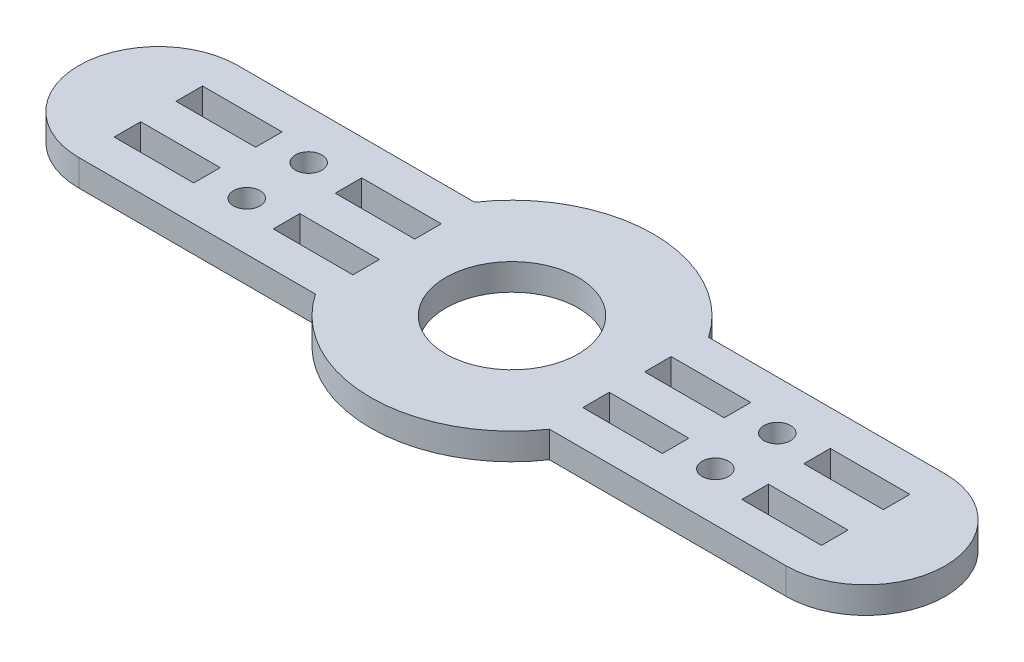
ISO-10303-21;
HEADER;
FILE_DESCRIPTION(('STEP AP214'),'2;1');
FILE_NAME('part.step','',(''),(''),'','','');
FILE_SCHEMA(('AUTOMOTIVE_DESIGN { 1 0 10303 214 1 1 1 1 }'));
ENDSEC;
DATA;
#1=APPLICATION_CONTEXT('core data for automotive mechanical design processes');
#2=APPLICATION_PROTOCOL_DEFINITION('international standard','automotive_design',2000,#1);
#3=PRODUCT_CONTEXT('',#1,'mechanical');
#4=PRODUCT('Part','Part','',(#3));
#5=PRODUCT_RELATED_PRODUCT_CATEGORY('part','',(#4));
#6=PRODUCT_DEFINITION_FORMATION('','',#4);
#7=PRODUCT_DEFINITION_CONTEXT('part definition',#1,'design');
#8=PRODUCT_DEFINITION('design','',#6,#7);
#9=PRODUCT_DEFINITION_SHAPE('','',#8);
#10=(LENGTH_UNIT() NAMED_UNIT(*) SI_UNIT(.MILLI.,.METRE.));
#11=(NAMED_UNIT(*) PLANE_ANGLE_UNIT() SI_UNIT($,.RADIAN.));
#12=(NAMED_UNIT(*) SI_UNIT($,.STERADIAN.) SOLID_ANGLE_UNIT());
#13=UNCERTAINTY_MEASURE_WITH_UNIT(LENGTH_MEASURE(1.E-05),#10,'distance_accuracy_value','');
#14=(GEOMETRIC_REPRESENTATION_CONTEXT(3) GLOBAL_UNCERTAINTY_ASSIGNED_CONTEXT((#13)) GLOBAL_UNIT_ASSIGNED_CONTEXT((#10,
#11,#12)) REPRESENTATION_CONTEXT('',''));
#15=CARTESIAN_POINT('',(0.,0.,0.));
#16=DIRECTION('',(0.,0.,1.));
#17=DIRECTION('',(1.,0.,0.));
#18=AXIS2_PLACEMENT_3D('',#15,#16,#17);
#19=CARTESIAN_POINT('',(0.,3.,8.99999999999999));
#20=DIRECTION('',(0.,0.,-1.));
#21=DIRECTION('',(-1.,0.,0.));
#22=AXIS2_PLACEMENT_3D('',#19,#20,#21);
#23=PLANE('',#22);
#24=DIRECTION('',(1.,0.,0.));
#25=VECTOR('',#24,1.);
#26=CARTESIAN_POINT('',(0.,0.,8.99999999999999));
#27=LINE('',#26,#25);
#28=CARTESIAN_POINT('',(-40.,0.,9.));
#29=VERTEX_POINT('',#28);
#30=CARTESIAN_POINT('',(-13.228756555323,0.,9.));
#31=VERTEX_POINT('',#30);
#32=EDGE_CURVE('E638',#29,#31,#27,.T.);
#33=ORIENTED_EDGE('',*,*,#32,.T.);
#34=DIRECTION('',(0.,-1.,0.));
#35=VECTOR('',#34,1.);
#36=CARTESIAN_POINT('',(-13.228756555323,3.,9.));
#37=LINE('',#36,#35);
#38=CARTESIAN_POINT('',(-13.228756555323,3.,9.));
#39=VERTEX_POINT('',#38);
#40=EDGE_CURVE('E11',#39,#31,#37,.T.);
#41=ORIENTED_EDGE('',*,*,#40,.F.);
#42=DIRECTION('',(1.,0.,0.));
#43=VECTOR('',#42,1.);
#44=CARTESIAN_POINT('',(0.,3.,8.99999999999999));
#45=LINE('',#44,#43);
#46=CARTESIAN_POINT('',(-40.,3.,9.));
#47=VERTEX_POINT('',#46);
#48=EDGE_CURVE('E331',#47,#39,#45,.T.);
#49=ORIENTED_EDGE('',*,*,#48,.F.);
#50=DIRECTION('',(0.,-1.,0.));
#51=VECTOR('',#50,1.);
#52=CARTESIAN_POINT('',(-40.,3.,9.));
#53=LINE('',#52,#51);
#54=EDGE_CURVE('E443',#47,#29,#53,.T.);
#55=ORIENTED_EDGE('',*,*,#54,.T.);
#56=EDGE_LOOP('',(#33,#41,#49,#55));
#57=FACE_BOUND('',#56,.T.);
#58=ADVANCED_FACE('F34',(#57),#23,.F.);
#59=CARTESIAN_POINT('',(0.,3.,0.));
#60=DIRECTION('',(0.,-1.,0.));
#61=DIRECTION('',(0.,0.,-1.));
#62=AXIS2_PLACEMENT_3D('',#59,#60,#61);
#63=CYLINDRICAL_SURFACE('',#62,16.);
#64=CARTESIAN_POINT('',(0.,0.,0.));
#65=DIRECTION('',(0.,1.,0.));
#66=DIRECTION('',(0.,0.,1.));
#67=AXIS2_PLACEMENT_3D('',#64,#65,#66);
#68=CIRCLE('',#67,16.);
#69=CARTESIAN_POINT('',(13.228756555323,0.,8.99999999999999));
#70=VERTEX_POINT('',#69);
#71=EDGE_CURVE('E641',#31,#70,#68,.T.);
#72=ORIENTED_EDGE('',*,*,#71,.T.);
#73=DIRECTION('',(0.,-1.,0.));
#74=VECTOR('',#73,1.);
#75=CARTESIAN_POINT('',(13.228756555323,3.,8.99999999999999));
#76=LINE('',#75,#74);
#77=CARTESIAN_POINT('',(13.228756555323,3.,8.99999999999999));
#78=VERTEX_POINT('',#77);
#79=EDGE_CURVE('E44',#78,#70,#76,.T.);
#80=ORIENTED_EDGE('',*,*,#79,.F.);
#81=CARTESIAN_POINT('',(0.,3.,0.));
#82=DIRECTION('',(0.,1.,0.));
#83=DIRECTION('',(0.,0.,1.));
#84=AXIS2_PLACEMENT_3D('',#81,#82,#83);
#85=CIRCLE('',#84,16.);
#86=EDGE_CURVE('E329',#39,#78,#85,.T.);
#87=ORIENTED_EDGE('',*,*,#86,.F.);
#88=ORIENTED_EDGE('',*,*,#40,.T.);
#89=EDGE_LOOP('',(#72,#80,#87,#88));
#90=FACE_BOUND('',#89,.T.);
#91=ADVANCED_FACE('F673',(#90),#63,.T.);
#92=CARTESIAN_POINT('',(40.,0.,8.99999999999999));
#93=VERTEX_POINT('',#92);
#94=EDGE_CURVE('E642',#70,#93,#27,.T.);
#95=ORIENTED_EDGE('',*,*,#94,.T.);
#96=DIRECTION('',(0.,-1.,0.));
#97=VECTOR('',#96,1.);
#98=CARTESIAN_POINT('',(40.,3.,8.99999999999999));
#99=LINE('',#98,#97);
#100=CARTESIAN_POINT('',(40.,3.,8.99999999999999));
#101=VERTEX_POINT('',#100);
#102=EDGE_CURVE('E450',#101,#93,#99,.T.);
#103=ORIENTED_EDGE('',*,*,#102,.F.);
#104=EDGE_CURVE('E326',#78,#101,#45,.T.);
#105=ORIENTED_EDGE('',*,*,#104,.F.);
#106=ORIENTED_EDGE('',*,*,#79,.T.);
#107=EDGE_LOOP('',(#95,#103,#105,#106));
#108=FACE_BOUND('',#107,.T.);
#109=ADVANCED_FACE('F675',(#108),#23,.F.);
#110=CARTESIAN_POINT('',(40.,3.,0.));
#111=DIRECTION('',(0.,-1.,0.));
#112=DIRECTION('',(0.,0.,-1.));
#113=AXIS2_PLACEMENT_3D('',#110,#111,#112);
#114=CYLINDRICAL_SURFACE('',#113,9.);
#115=CARTESIAN_POINT('',(40.,0.,0.));
#116=DIRECTION('',(0.,1.,0.));
#117=DIRECTION('',(0.,0.,1.));
#118=AXIS2_PLACEMENT_3D('',#115,#116,#117);
#119=CIRCLE('',#118,9.);
#120=CARTESIAN_POINT('',(40.,0.,-9.00000000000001));
#121=VERTEX_POINT('',#120);
#122=EDGE_CURVE('E644',#93,#121,#119,.T.);
#123=ORIENTED_EDGE('',*,*,#122,.T.);
#124=DIRECTION('',(0.,-1.,0.));
#125=VECTOR('',#124,1.);
#126=CARTESIAN_POINT('',(40.,3.,-9.00000000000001));
#127=LINE('',#126,#125);
#128=CARTESIAN_POINT('',(40.,3.,-9.00000000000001));
#129=VERTEX_POINT('',#128);
#130=EDGE_CURVE('E448',#129,#121,#127,.T.);
#131=ORIENTED_EDGE('',*,*,#130,.F.);
#132=CARTESIAN_POINT('',(40.,3.,0.));
#133=DIRECTION('',(0.,1.,0.));
#134=DIRECTION('',(0.,0.,1.));
#135=AXIS2_PLACEMENT_3D('',#132,#133,#134);
#136=CIRCLE('',#135,9.);
#137=EDGE_CURVE('E324',#101,#129,#136,.T.);
#138=ORIENTED_EDGE('',*,*,#137,.F.);
#139=ORIENTED_EDGE('',*,*,#102,.T.);
#140=EDGE_LOOP('',(#123,#131,#138,#139));
#141=FACE_BOUND('',#140,.T.);
#142=ADVANCED_FACE('F683',(#141),#114,.T.);
#143=CARTESIAN_POINT('',(0.,3.,-9.00000000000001));
#144=DIRECTION('',(0.,0.,-1.));
#145=DIRECTION('',(-1.,0.,0.));
#146=AXIS2_PLACEMENT_3D('',#143,#144,#145);
#147=PLANE('',#146);
#148=DIRECTION('',(1.,0.,0.));
#149=VECTOR('',#148,1.);
#150=CARTESIAN_POINT('',(0.,0.,-9.00000000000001));
#151=LINE('',#150,#149);
#152=CARTESIAN_POINT('',(13.2287565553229,0.,-9.00000000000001));
#153=VERTEX_POINT('',#152);
#154=EDGE_CURVE('E647',#153,#121,#151,.T.);
#155=ORIENTED_EDGE('',*,*,#154,.F.);
#156=DIRECTION('',(0.,-1.,0.));
#157=VECTOR('',#156,1.);
#158=CARTESIAN_POINT('',(13.2287565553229,3.,-9.00000000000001));
#159=LINE('',#158,#157);
#160=CARTESIAN_POINT('',(13.2287565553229,3.,-9.00000000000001));
#161=VERTEX_POINT('',#160);
#162=EDGE_CURVE('E317',#161,#153,#159,.T.);
#163=ORIENTED_EDGE('',*,*,#162,.F.);
#164=DIRECTION('',(1.,0.,0.));
#165=VECTOR('',#164,1.);
#166=CARTESIAN_POINT('',(0.,3.,-9.00000000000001));
#167=LINE('',#166,#165);
#168=EDGE_CURVE('E306',#161,#129,#167,.T.);
#169=ORIENTED_EDGE('',*,*,#168,.T.);
#170=ORIENTED_EDGE('',*,*,#130,.T.);
#171=EDGE_LOOP('',(#155,#163,#169,#170));
#172=FACE_BOUND('',#171,.T.);
#173=ADVANCED_FACE('F688',(#172),#147,.T.);
#174=CARTESIAN_POINT('',(0.,3.,0.));
#175=DIRECTION('',(0.,-1.,0.));
#176=DIRECTION('',(0.,0.,-1.));
#177=AXIS2_PLACEMENT_3D('',#174,#175,#176);
#178=CYLINDRICAL_SURFACE('',#177,16.);
#179=CARTESIAN_POINT('',(0.,0.,0.));
#180=DIRECTION('',(0.,1.,0.));
#181=DIRECTION('',(0.,0.,1.));
#182=AXIS2_PLACEMENT_3D('',#179,#180,#181);
#183=CIRCLE('',#182,16.);
#184=CARTESIAN_POINT('',(-13.228756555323,0.,-9.00000000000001));
#185=VERTEX_POINT('',#184);
#186=EDGE_CURVE('E313',#153,#185,#183,.T.);
#187=ORIENTED_EDGE('',*,*,#186,.T.);
#188=DIRECTION('',(0.,-1.,0.));
#189=VECTOR('',#188,1.);
#190=CARTESIAN_POINT('',(-13.228756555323,3.,-9.00000000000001));
#191=LINE('',#190,#189);
#192=CARTESIAN_POINT('',(-13.228756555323,3.,-9.00000000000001));
#193=VERTEX_POINT('',#192);
#194=EDGE_CURVE('E310',#193,#185,#191,.T.);
#195=ORIENTED_EDGE('',*,*,#194,.F.);
#196=CARTESIAN_POINT('',(0.,3.,0.));
#197=DIRECTION('',(0.,1.,0.));
#198=DIRECTION('',(0.,0.,1.));
#199=AXIS2_PLACEMENT_3D('',#196,#197,#198);
#200=CIRCLE('',#199,16.);
#201=EDGE_CURVE('E299',#161,#193,#200,.T.);
#202=ORIENTED_EDGE('',*,*,#201,.F.);
#203=ORIENTED_EDGE('',*,*,#162,.T.);
#204=EDGE_LOOP('',(#187,#195,#202,#203));
#205=FACE_BOUND('',#204,.T.);
#206=ADVANCED_FACE('F311',(#205),#178,.T.);
#207=CARTESIAN_POINT('',(-40.,0.,-9.));
#208=VERTEX_POINT('',#207);
#209=EDGE_CURVE('E439',#208,#185,#151,.T.);
#210=ORIENTED_EDGE('',*,*,#209,.F.);
#211=DIRECTION('',(0.,-1.,0.));
#212=VECTOR('',#211,1.);
#213=CARTESIAN_POINT('',(-40.,3.,-9.));
#214=LINE('',#213,#212);
#215=CARTESIAN_POINT('',(-40.,3.,-9.));
#216=VERTEX_POINT('',#215);
#217=EDGE_CURVE('E177',#216,#208,#214,.T.);
#218=ORIENTED_EDGE('',*,*,#217,.F.);
#219=EDGE_CURVE('E304',#216,#193,#167,.T.);
#220=ORIENTED_EDGE('',*,*,#219,.T.);
#221=ORIENTED_EDGE('',*,*,#194,.T.);
#222=EDGE_LOOP('',(#210,#218,#220,#221));
#223=FACE_BOUND('',#222,.T.);
#224=ADVANCED_FACE('F319',(#223),#147,.T.);
#225=CARTESIAN_POINT('',(31.,3.,0.));
#226=DIRECTION('',(1.,0.,0.));
#227=DIRECTION('',(0.,0.,-1.));
#228=AXIS2_PLACEMENT_3D('',#225,#226,#227);
#229=PLANE('',#228);
#230=DIRECTION('',(0.,0.,1.));
#231=VECTOR('',#230,1.);
#232=CARTESIAN_POINT('',(31.,0.,0.));
#233=LINE('',#232,#231);
#234=CARTESIAN_POINT('',(31.,0.,-5.));
#235=VERTEX_POINT('',#234);
#236=CARTESIAN_POINT('',(31.,0.,-2.));
#237=VERTEX_POINT('',#236);
#238=EDGE_CURVE('E623',#235,#237,#233,.T.);
#239=ORIENTED_EDGE('',*,*,#238,.F.);
#240=DIRECTION('',(0.,-1.,0.));
#241=VECTOR('',#240,1.);
#242=CARTESIAN_POINT('',(31.,3.,-5.));
#243=LINE('',#242,#241);
#244=CARTESIAN_POINT('',(31.,3.,-5.));
#245=VERTEX_POINT('',#244);
#246=EDGE_CURVE('E445',#245,#235,#243,.T.);
#247=ORIENTED_EDGE('',*,*,#246,.F.);
#248=DIRECTION('',(0.,0.,1.));
#249=VECTOR('',#248,1.);
#250=CARTESIAN_POINT('',(31.,3.,0.));
#251=LINE('',#250,#249);
#252=CARTESIAN_POINT('',(31.,3.,-2.));
#253=VERTEX_POINT('',#252);
#254=EDGE_CURVE('E345',#245,#253,#251,.T.);
#255=ORIENTED_EDGE('',*,*,#254,.T.);
#256=DIRECTION('',(0.,-1.,0.));
#257=VECTOR('',#256,1.);
#258=CARTESIAN_POINT('',(31.,3.,-2.));
#259=LINE('',#258,#257);
#260=EDGE_CURVE('E455',#253,#237,#259,.T.);
#261=ORIENTED_EDGE('',*,*,#260,.T.);
#262=EDGE_LOOP('',(#239,#247,#255,#261));
#263=FACE_BOUND('',#262,.T.);
#264=ADVANCED_FACE('F700',(#263),#229,.T.);
#265=CARTESIAN_POINT('',(0.,3.,-5.00000000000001));
#266=DIRECTION('',(0.,0.,1.));
#267=DIRECTION('',(1.,0.,0.));
#268=AXIS2_PLACEMENT_3D('',#265,#266,#267);
#269=PLANE('',#268);
#270=DIRECTION('',(-1.,0.,0.));
#271=VECTOR('',#270,1.);
#272=CARTESIAN_POINT('',(0.,0.,-5.00000000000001));
#273=LINE('',#272,#271);
#274=CARTESIAN_POINT('',(40.,0.,-5.));
#275=VERTEX_POINT('',#274);
#276=EDGE_CURVE('E626',#275,#235,#273,.T.);
#277=ORIENTED_EDGE('',*,*,#276,.F.);
#278=DIRECTION('',(0.,-1.,0.));
#279=VECTOR('',#278,1.);
#280=CARTESIAN_POINT('',(40.,3.,-5.));
#281=LINE('',#280,#279);
#282=CARTESIAN_POINT('',(40.,3.,-5.));
#283=VERTEX_POINT('',#282);
#284=EDGE_CURVE('E461',#283,#275,#281,.T.);
#285=ORIENTED_EDGE('',*,*,#284,.F.);
#286=DIRECTION('',(-1.,0.,0.));
#287=VECTOR('',#286,1.);
#288=CARTESIAN_POINT('',(0.,3.,-5.00000000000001));
#289=LINE('',#288,#287);
#290=EDGE_CURVE('E342',#283,#245,#289,.T.);
#291=ORIENTED_EDGE('',*,*,#290,.T.);
#292=ORIENTED_EDGE('',*,*,#246,.T.);
#293=EDGE_LOOP('',(#277,#285,#291,#292));
#294=FACE_BOUND('',#293,.T.);
#295=ADVANCED_FACE('F704',(#294),#269,.T.);
#296=CARTESIAN_POINT('',(40.,3.,0.));
#297=DIRECTION('',(1.,0.,0.));
#298=DIRECTION('',(0.,0.,-1.));
#299=AXIS2_PLACEMENT_3D('',#296,#297,#298);
#300=PLANE('',#299);
#301=DIRECTION('',(0.,0.,1.));
#302=VECTOR('',#301,1.);
#303=CARTESIAN_POINT('',(40.,0.,0.));
#304=LINE('',#303,#302);
#305=CARTESIAN_POINT('',(40.,0.,-2.));
#306=VERTEX_POINT('',#305);
#307=EDGE_CURVE('E629',#275,#306,#304,.T.);
#308=ORIENTED_EDGE('',*,*,#307,.T.);
#309=DIRECTION('',(0.,-1.,0.));
#310=VECTOR('',#309,1.);
#311=CARTESIAN_POINT('',(40.,3.,-2.));
#312=LINE('',#311,#310);
#313=CARTESIAN_POINT('',(40.,3.,-2.));
#314=VERTEX_POINT('',#313);
#315=EDGE_CURVE('E457',#314,#306,#312,.T.);
#316=ORIENTED_EDGE('',*,*,#315,.F.);
#317=DIRECTION('',(0.,0.,1.));
#318=VECTOR('',#317,1.);
#319=CARTESIAN_POINT('',(40.,3.,0.));
#320=LINE('',#319,#318);
#321=EDGE_CURVE('E339',#283,#314,#320,.T.);
#322=ORIENTED_EDGE('',*,*,#321,.F.);
#323=ORIENTED_EDGE('',*,*,#284,.T.);
#324=EDGE_LOOP('',(#308,#316,#322,#323));
#325=FACE_BOUND('',#324,.T.);
#326=ADVANCED_FACE('F710',(#325),#300,.F.);
#327=CARTESIAN_POINT('',(13.,3.,0.));
#328=DIRECTION('',(1.,0.,0.));
#329=DIRECTION('',(0.,0.,-1.));
#330=AXIS2_PLACEMENT_3D('',#327,#328,#329);
#331=PLANE('',#330);
#332=DIRECTION('',(0.,0.,1.));
#333=VECTOR('',#332,1.);
#334=CARTESIAN_POINT('',(13.,0.,0.));
#335=LINE('',#334,#333);
#336=CARTESIAN_POINT('',(13.,0.,-5.));
#337=VERTEX_POINT('',#336);
#338=CARTESIAN_POINT('',(13.,0.,-1.99999999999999));
#339=VERTEX_POINT('',#338);
#340=EDGE_CURVE('E611',#337,#339,#335,.T.);
#341=ORIENTED_EDGE('',*,*,#340,.F.);
#342=DIRECTION('',(0.,-1.,0.));
#343=VECTOR('',#342,1.);
#344=CARTESIAN_POINT('',(13.,3.,-5.));
#345=LINE('',#344,#343);
#346=CARTESIAN_POINT('',(13.,3.,-5.));
#347=VERTEX_POINT('',#346);
#348=EDGE_CURVE('E458',#347,#337,#345,.T.);
#349=ORIENTED_EDGE('',*,*,#348,.F.);
#350=DIRECTION('',(0.,0.,1.));
#351=VECTOR('',#350,1.);
#352=CARTESIAN_POINT('',(13.,3.,0.));
#353=LINE('',#352,#351);
#354=CARTESIAN_POINT('',(13.,3.,-1.99999999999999));
#355=VERTEX_POINT('',#354);
#356=EDGE_CURVE('E356',#347,#355,#353,.T.);
#357=ORIENTED_EDGE('',*,*,#356,.T.);
#358=DIRECTION('',(0.,-1.,0.));
#359=VECTOR('',#358,1.);
#360=CARTESIAN_POINT('',(13.,3.,-1.99999999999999));
#361=LINE('',#360,#359);
#362=EDGE_CURVE('E464',#355,#339,#361,.T.);
#363=ORIENTED_EDGE('',*,*,#362,.T.);
#364=EDGE_LOOP('',(#341,#349,#357,#363));
#365=FACE_BOUND('',#364,.T.);
#366=ADVANCED_FACE('F729',(#365),#331,.T.);
#367=CARTESIAN_POINT('',(0.,3.,-5.));
#368=DIRECTION('',(0.,0.,1.));
#369=DIRECTION('',(1.,0.,0.));
#370=AXIS2_PLACEMENT_3D('',#367,#368,#369);
#371=PLANE('',#370);
#372=DIRECTION('',(-1.,0.,0.));
#373=VECTOR('',#372,1.);
#374=CARTESIAN_POINT('',(0.,0.,-5.));
#375=LINE('',#374,#373);
#376=CARTESIAN_POINT('',(22.,0.,-5.));
#377=VERTEX_POINT('',#376);
#378=EDGE_CURVE('E614',#377,#337,#375,.T.);
#379=ORIENTED_EDGE('',*,*,#378,.F.);
#380=DIRECTION('',(0.,-1.,0.));
#381=VECTOR('',#380,1.);
#382=CARTESIAN_POINT('',(22.,3.,-5.));
#383=LINE('',#382,#381);
#384=CARTESIAN_POINT('',(22.,3.,-5.));
#385=VERTEX_POINT('',#384);
#386=EDGE_CURVE('E470',#385,#377,#383,.T.);
#387=ORIENTED_EDGE('',*,*,#386,.F.);
#388=DIRECTION('',(-1.,0.,0.));
#389=VECTOR('',#388,1.);
#390=CARTESIAN_POINT('',(0.,3.,-5.));
#391=LINE('',#390,#389);
#392=EDGE_CURVE('E353',#385,#347,#391,.T.);
#393=ORIENTED_EDGE('',*,*,#392,.T.);
#394=ORIENTED_EDGE('',*,*,#348,.T.);
#395=EDGE_LOOP('',(#379,#387,#393,#394));
#396=FACE_BOUND('',#395,.T.);
#397=ADVANCED_FACE('F725',(#396),#371,.T.);
#398=CARTESIAN_POINT('',(22.,3.,0.));
#399=DIRECTION('',(1.,0.,0.));
#400=DIRECTION('',(0.,0.,-1.));
#401=AXIS2_PLACEMENT_3D('',#398,#399,#400);
#402=PLANE('',#401);
#403=DIRECTION('',(0.,0.,1.));
#404=VECTOR('',#403,1.);
#405=CARTESIAN_POINT('',(22.,0.,0.));
#406=LINE('',#405,#404);
#407=CARTESIAN_POINT('',(22.,0.,-2.));
#408=VERTEX_POINT('',#407);
#409=EDGE_CURVE('E617',#377,#408,#406,.T.);
#410=ORIENTED_EDGE('',*,*,#409,.T.);
#411=DIRECTION('',(0.,-1.,0.));
#412=VECTOR('',#411,1.);
#413=CARTESIAN_POINT('',(22.,3.,-2.));
#414=LINE('',#413,#412);
#415=CARTESIAN_POINT('',(22.,3.,-2.));
#416=VERTEX_POINT('',#415);
#417=EDGE_CURVE('E466',#416,#408,#414,.T.);
#418=ORIENTED_EDGE('',*,*,#417,.F.);
#419=DIRECTION('',(0.,0.,1.));
#420=VECTOR('',#419,1.);
#421=CARTESIAN_POINT('',(22.,3.,0.));
#422=LINE('',#421,#420);
#423=EDGE_CURVE('E350',#385,#416,#422,.T.);
#424=ORIENTED_EDGE('',*,*,#423,.F.);
#425=ORIENTED_EDGE('',*,*,#386,.T.);
#426=EDGE_LOOP('',(#410,#418,#424,#425));
#427=FACE_BOUND('',#426,.T.);
#428=ADVANCED_FACE('F721',(#427),#402,.F.);
#429=CARTESIAN_POINT('',(-31.,3.,0.));
#430=DIRECTION('',(-1.,0.,0.));
#431=DIRECTION('',(0.,0.,1.));
#432=AXIS2_PLACEMENT_3D('',#429,#430,#431);
#433=PLANE('',#432);
#434=DIRECTION('',(0.,0.,-1.));
#435=VECTOR('',#434,1.);
#436=CARTESIAN_POINT('',(-31.,0.,0.));
#437=LINE('',#436,#435);
#438=CARTESIAN_POINT('',(-31.,0.,5.));
#439=VERTEX_POINT('',#438);
#440=CARTESIAN_POINT('',(-31.,0.,2.));
#441=VERTEX_POINT('',#440);
#442=EDGE_CURVE('E599',#439,#441,#437,.T.);
#443=ORIENTED_EDGE('',*,*,#442,.F.);
#444=DIRECTION('',(0.,-1.,0.));
#445=VECTOR('',#444,1.);
#446=CARTESIAN_POINT('',(-31.,3.,5.));
#447=LINE('',#446,#445);
#448=CARTESIAN_POINT('',(-31.,3.,5.));
#449=VERTEX_POINT('',#448);
#450=EDGE_CURVE('E467',#449,#439,#447,.T.);
#451=ORIENTED_EDGE('',*,*,#450,.F.);
#452=DIRECTION('',(0.,0.,-1.));
#453=VECTOR('',#452,1.);
#454=CARTESIAN_POINT('',(-31.,3.,0.));
#455=LINE('',#454,#453);
#456=CARTESIAN_POINT('',(-31.,3.,2.));
#457=VERTEX_POINT('',#456);
#458=EDGE_CURVE('E367',#449,#457,#455,.T.);
#459=ORIENTED_EDGE('',*,*,#458,.T.);
#460=DIRECTION('',(0.,-1.,0.));
#461=VECTOR('',#460,1.);
#462=CARTESIAN_POINT('',(-31.,3.,2.));
#463=LINE('',#462,#461);
#464=EDGE_CURVE('E473',#457,#441,#463,.T.);
#465=ORIENTED_EDGE('',*,*,#464,.T.);
#466=EDGE_LOOP('',(#443,#451,#459,#465));
#467=FACE_BOUND('',#466,.T.);
#468=ADVANCED_FACE('F724',(#467),#433,.T.);
#469=CARTESIAN_POINT('',(0.,3.,5.00000000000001));
#470=DIRECTION('',(0.,0.,-1.));
#471=DIRECTION('',(-1.,0.,0.));
#472=AXIS2_PLACEMENT_3D('',#469,#470,#471);
#473=PLANE('',#472);
#474=DIRECTION('',(1.,0.,0.));
#475=VECTOR('',#474,1.);
#476=CARTESIAN_POINT('',(0.,0.,5.00000000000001));
#477=LINE('',#476,#475);
#478=CARTESIAN_POINT('',(-40.,0.,5.));
#479=VERTEX_POINT('',#478);
#480=EDGE_CURVE('E602',#479,#439,#477,.T.);
#481=ORIENTED_EDGE('',*,*,#480,.F.);
#482=DIRECTION('',(0.,-1.,0.));
#483=VECTOR('',#482,1.);
#484=CARTESIAN_POINT('',(-40.,3.,5.));
#485=LINE('',#484,#483);
#486=CARTESIAN_POINT('',(-40.,3.,5.));
#487=VERTEX_POINT('',#486);
#488=EDGE_CURVE('E479',#487,#479,#485,.T.);
#489=ORIENTED_EDGE('',*,*,#488,.F.);
#490=DIRECTION('',(1.,0.,0.));
#491=VECTOR('',#490,1.);
#492=CARTESIAN_POINT('',(0.,3.,5.00000000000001));
#493=LINE('',#492,#491);
#494=EDGE_CURVE('E364',#487,#449,#493,.T.);
#495=ORIENTED_EDGE('',*,*,#494,.T.);
#496=ORIENTED_EDGE('',*,*,#450,.T.);
#497=EDGE_LOOP('',(#481,#489,#495,#496));
#498=FACE_BOUND('',#497,.T.);
#499=ADVANCED_FACE('F742',(#498),#473,.T.);
#500=CARTESIAN_POINT('',(-40.,3.,0.));
#501=DIRECTION('',(-1.,0.,0.));
#502=DIRECTION('',(0.,0.,1.));
#503=AXIS2_PLACEMENT_3D('',#500,#501,#502);
#504=PLANE('',#503);
#505=DIRECTION('',(0.,0.,-1.));
#506=VECTOR('',#505,1.);
#507=CARTESIAN_POINT('',(-40.,0.,0.));
#508=LINE('',#507,#506);
#509=CARTESIAN_POINT('',(-40.,0.,2.));
#510=VERTEX_POINT('',#509);
#511=EDGE_CURVE('E605',#479,#510,#508,.T.);
#512=ORIENTED_EDGE('',*,*,#511,.T.);
#513=DIRECTION('',(0.,-1.,0.));
#514=VECTOR('',#513,1.);
#515=CARTESIAN_POINT('',(-40.,3.,2.));
#516=LINE('',#515,#514);
#517=CARTESIAN_POINT('',(-40.,3.,2.));
#518=VERTEX_POINT('',#517);
#519=EDGE_CURVE('E475',#518,#510,#516,.T.);
#520=ORIENTED_EDGE('',*,*,#519,.F.);
#521=DIRECTION('',(0.,0.,-1.));
#522=VECTOR('',#521,1.);
#523=CARTESIAN_POINT('',(-40.,3.,0.));
#524=LINE('',#523,#522);
#525=EDGE_CURVE('E361',#487,#518,#524,.T.);
#526=ORIENTED_EDGE('',*,*,#525,.F.);
#527=ORIENTED_EDGE('',*,*,#488,.T.);
#528=EDGE_LOOP('',(#512,#520,#526,#527));
#529=FACE_BOUND('',#528,.T.);
#530=ADVANCED_FACE('F738',(#529),#504,.F.);
#531=CARTESIAN_POINT('',(-13.,3.,0.));
#532=DIRECTION('',(-1.,0.,0.));
#533=DIRECTION('',(0.,0.,1.));
#534=AXIS2_PLACEMENT_3D('',#531,#532,#533);
#535=PLANE('',#534);
#536=DIRECTION('',(0.,0.,-1.));
#537=VECTOR('',#536,1.);
#538=CARTESIAN_POINT('',(-13.,0.,0.));
#539=LINE('',#538,#537);
#540=CARTESIAN_POINT('',(-13.,0.,5.));
#541=VERTEX_POINT('',#540);
#542=CARTESIAN_POINT('',(-13.,0.,1.99999999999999));
#543=VERTEX_POINT('',#542);
#544=EDGE_CURVE('E587',#541,#543,#539,.T.);
#545=ORIENTED_EDGE('',*,*,#544,.F.);
#546=DIRECTION('',(0.,-1.,0.));
#547=VECTOR('',#546,1.);
#548=CARTESIAN_POINT('',(-13.,3.,5.));
#549=LINE('',#548,#547);
#550=CARTESIAN_POINT('',(-13.,3.,5.));
#551=VERTEX_POINT('',#550);
#552=EDGE_CURVE('E476',#551,#541,#549,.T.);
#553=ORIENTED_EDGE('',*,*,#552,.F.);
#554=DIRECTION('',(0.,0.,-1.));
#555=VECTOR('',#554,1.);
#556=CARTESIAN_POINT('',(-13.,3.,0.));
#557=LINE('',#556,#555);
#558=CARTESIAN_POINT('',(-13.,3.,1.99999999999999));
#559=VERTEX_POINT('',#558);
#560=EDGE_CURVE('E378',#551,#559,#557,.T.);
#561=ORIENTED_EDGE('',*,*,#560,.T.);
#562=DIRECTION('',(0.,-1.,0.));
#563=VECTOR('',#562,1.);
#564=CARTESIAN_POINT('',(-13.,3.,1.99999999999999));
#565=LINE('',#564,#563);
#566=EDGE_CURVE('E482',#559,#543,#565,.T.);
#567=ORIENTED_EDGE('',*,*,#566,.T.);
#568=EDGE_LOOP('',(#545,#553,#561,#567));
#569=FACE_BOUND('',#568,.T.);
#570=ADVANCED_FACE('F741',(#569),#535,.T.);
#571=CARTESIAN_POINT('',(0.,3.,5.));
#572=DIRECTION('',(0.,0.,-1.));
#573=DIRECTION('',(-1.,0.,0.));
#574=AXIS2_PLACEMENT_3D('',#571,#572,#573);
#575=PLANE('',#574);
#576=DIRECTION('',(1.,0.,0.));
#577=VECTOR('',#576,1.);
#578=CARTESIAN_POINT('',(0.,0.,5.));
#579=LINE('',#578,#577);
#580=CARTESIAN_POINT('',(-22.,0.,5.));
#581=VERTEX_POINT('',#580);
#582=EDGE_CURVE('E590',#581,#541,#579,.T.);
#583=ORIENTED_EDGE('',*,*,#582,.F.);
#584=DIRECTION('',(0.,-1.,0.));
#585=VECTOR('',#584,1.);
#586=CARTESIAN_POINT('',(-22.,3.,5.));
#587=LINE('',#586,#585);
#588=CARTESIAN_POINT('',(-22.,3.,5.));
#589=VERTEX_POINT('',#588);
#590=EDGE_CURVE('E488',#589,#581,#587,.T.);
#591=ORIENTED_EDGE('',*,*,#590,.F.);
#592=DIRECTION('',(1.,0.,0.));
#593=VECTOR('',#592,1.);
#594=CARTESIAN_POINT('',(0.,3.,5.));
#595=LINE('',#594,#593);
#596=EDGE_CURVE('E375',#589,#551,#595,.T.);
#597=ORIENTED_EDGE('',*,*,#596,.T.);
#598=ORIENTED_EDGE('',*,*,#552,.T.);
#599=EDGE_LOOP('',(#583,#591,#597,#598));
#600=FACE_BOUND('',#599,.T.);
#601=ADVANCED_FACE('F758',(#600),#575,.T.);
#602=CARTESIAN_POINT('',(-22.,3.,0.));
#603=DIRECTION('',(-1.,0.,0.));
#604=DIRECTION('',(0.,0.,1.));
#605=AXIS2_PLACEMENT_3D('',#602,#603,#604);
#606=PLANE('',#605);
#607=DIRECTION('',(0.,0.,-1.));
#608=VECTOR('',#607,1.);
#609=CARTESIAN_POINT('',(-22.,0.,0.));
#610=LINE('',#609,#608);
#611=CARTESIAN_POINT('',(-22.,0.,2.));
#612=VERTEX_POINT('',#611);
#613=EDGE_CURVE('E593',#581,#612,#610,.T.);
#614=ORIENTED_EDGE('',*,*,#613,.T.);
#615=DIRECTION('',(0.,-1.,0.));
#616=VECTOR('',#615,1.);
#617=CARTESIAN_POINT('',(-22.,3.,2.));
#618=LINE('',#617,#616);
#619=CARTESIAN_POINT('',(-22.,3.,2.));
#620=VERTEX_POINT('',#619);
#621=EDGE_CURVE('E484',#620,#612,#618,.T.);
#622=ORIENTED_EDGE('',*,*,#621,.F.);
#623=DIRECTION('',(0.,0.,-1.));
#624=VECTOR('',#623,1.);
#625=CARTESIAN_POINT('',(-22.,3.,0.));
#626=LINE('',#625,#624);
#627=EDGE_CURVE('E372',#589,#620,#626,.T.);
#628=ORIENTED_EDGE('',*,*,#627,.F.);
#629=ORIENTED_EDGE('',*,*,#590,.T.);
#630=EDGE_LOOP('',(#614,#622,#628,#629));
#631=FACE_BOUND('',#630,.T.);
#632=ADVANCED_FACE('F754',(#631),#606,.F.);
#633=CARTESIAN_POINT('',(-40.,3.,0.));
#634=DIRECTION('',(1.,0.,0.));
#635=DIRECTION('',(0.,0.,-1.));
#636=AXIS2_PLACEMENT_3D('',#633,#634,#635);
#637=PLANE('',#636);
#638=DIRECTION('',(0.,0.,1.));
#639=VECTOR('',#638,1.);
#640=CARTESIAN_POINT('',(-40.,0.,0.));
#641=LINE('',#640,#639);
#642=CARTESIAN_POINT('',(-40.,0.,-5.));
#643=VERTEX_POINT('',#642);
#644=CARTESIAN_POINT('',(-40.,0.,-2.));
#645=VERTEX_POINT('',#644);
#646=EDGE_CURVE('E575',#643,#645,#641,.T.);
#647=ORIENTED_EDGE('',*,*,#646,.F.);
#648=DIRECTION('',(0.,-1.,0.));
#649=VECTOR('',#648,1.);
#650=CARTESIAN_POINT('',(-40.,3.,-5.));
#651=LINE('',#650,#649);
#652=CARTESIAN_POINT('',(-40.,3.,-5.));
#653=VERTEX_POINT('',#652);
#654=EDGE_CURVE('E485',#653,#643,#651,.T.);
#655=ORIENTED_EDGE('',*,*,#654,.F.);
#656=DIRECTION('',(0.,0.,1.));
#657=VECTOR('',#656,1.);
#658=CARTESIAN_POINT('',(-40.,3.,0.));
#659=LINE('',#658,#657);
#660=CARTESIAN_POINT('',(-40.,3.,-2.));
#661=VERTEX_POINT('',#660);
#662=EDGE_CURVE('E389',#653,#661,#659,.T.);
#663=ORIENTED_EDGE('',*,*,#662,.T.);
#664=DIRECTION('',(0.,-1.,0.));
#665=VECTOR('',#664,1.);
#666=CARTESIAN_POINT('',(-40.,3.,-2.));
#667=LINE('',#666,#665);
#668=EDGE_CURVE('E491',#661,#645,#667,.T.);
#669=ORIENTED_EDGE('',*,*,#668,.T.);
#670=EDGE_LOOP('',(#647,#655,#663,#669));
#671=FACE_BOUND('',#670,.T.);
#672=ADVANCED_FACE('F757',(#671),#637,.T.);
#673=CARTESIAN_POINT('',(0.,3.,-5.00000000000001));
#674=DIRECTION('',(0.,0.,-1.));
#675=DIRECTION('',(-1.,0.,0.));
#676=AXIS2_PLACEMENT_3D('',#673,#674,#675);
#677=PLANE('',#676);
#678=DIRECTION('',(1.,0.,0.));
#679=VECTOR('',#678,1.);
#680=CARTESIAN_POINT('',(0.,0.,-5.00000000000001));
#681=LINE('',#680,#679);
#682=CARTESIAN_POINT('',(-31.,0.,-5.));
#683=VERTEX_POINT('',#682);
#684=EDGE_CURVE('E578',#643,#683,#681,.T.);
#685=ORIENTED_EDGE('',*,*,#684,.T.);
#686=DIRECTION('',(0.,-1.,0.));
#687=VECTOR('',#686,1.);
#688=CARTESIAN_POINT('',(-31.,3.,-5.));
#689=LINE('',#688,#687);
#690=CARTESIAN_POINT('',(-31.,3.,-5.));
#691=VERTEX_POINT('',#690);
#692=EDGE_CURVE('E496',#691,#683,#689,.T.);
#693=ORIENTED_EDGE('',*,*,#692,.F.);
#694=DIRECTION('',(1.,0.,0.));
#695=VECTOR('',#694,1.);
#696=CARTESIAN_POINT('',(0.,3.,-5.00000000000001));
#697=LINE('',#696,#695);
#698=EDGE_CURVE('E386',#653,#691,#697,.T.);
#699=ORIENTED_EDGE('',*,*,#698,.F.);
#700=ORIENTED_EDGE('',*,*,#654,.T.);
#701=EDGE_LOOP('',(#685,#693,#699,#700));
#702=FACE_BOUND('',#701,.T.);
#703=ADVANCED_FACE('F774',(#702),#677,.F.);
#704=CARTESIAN_POINT('',(-31.,3.,0.));
#705=DIRECTION('',(1.,0.,0.));
#706=DIRECTION('',(0.,0.,-1.));
#707=AXIS2_PLACEMENT_3D('',#704,#705,#706);
#708=PLANE('',#707);
#709=DIRECTION('',(0.,0.,1.));
#710=VECTOR('',#709,1.);
#711=CARTESIAN_POINT('',(-31.,0.,0.));
#712=LINE('',#711,#710);
#713=CARTESIAN_POINT('',(-31.,0.,-2.));
#714=VERTEX_POINT('',#713);
#715=EDGE_CURVE('E581',#683,#714,#712,.T.);
#716=ORIENTED_EDGE('',*,*,#715,.T.);
#717=DIRECTION('',(0.,-1.,0.));
#718=VECTOR('',#717,1.);
#719=CARTESIAN_POINT('',(-31.,3.,-2.));
#720=LINE('',#719,#718);
#721=CARTESIAN_POINT('',(-31.,3.,-2.));
#722=VERTEX_POINT('',#721);
#723=EDGE_CURVE('E493',#722,#714,#720,.T.);
#724=ORIENTED_EDGE('',*,*,#723,.F.);
#725=DIRECTION('',(0.,0.,1.));
#726=VECTOR('',#725,1.);
#727=CARTESIAN_POINT('',(-31.,3.,0.));
#728=LINE('',#727,#726);
#729=EDGE_CURVE('E384',#691,#722,#728,.T.);
#730=ORIENTED_EDGE('',*,*,#729,.F.);
#731=ORIENTED_EDGE('',*,*,#692,.T.);
#732=EDGE_LOOP('',(#716,#724,#730,#731));
#733=FACE_BOUND('',#732,.T.);
#734=ADVANCED_FACE('F770',(#733),#708,.F.);
#735=CARTESIAN_POINT('',(-22.,3.,0.));
#736=DIRECTION('',(1.,0.,0.));
#737=DIRECTION('',(0.,0.,-1.));
#738=AXIS2_PLACEMENT_3D('',#735,#736,#737);
#739=PLANE('',#738);
#740=DIRECTION('',(0.,0.,1.));
#741=VECTOR('',#740,1.);
#742=CARTESIAN_POINT('',(-22.,0.,0.));
#743=LINE('',#742,#741);
#744=CARTESIAN_POINT('',(-22.,0.,-5.));
#745=VERTEX_POINT('',#744);
#746=CARTESIAN_POINT('',(-22.,0.,-2.));
#747=VERTEX_POINT('',#746);
#748=EDGE_CURVE('E563',#745,#747,#743,.T.);
#749=ORIENTED_EDGE('',*,*,#748,.F.);
#750=DIRECTION('',(0.,-1.,0.));
#751=VECTOR('',#750,1.);
#752=CARTESIAN_POINT('',(-22.,3.,-5.));
#753=LINE('',#752,#751);
#754=CARTESIAN_POINT('',(-22.,3.,-5.));
#755=VERTEX_POINT('',#754);
#756=EDGE_CURVE('E494',#755,#745,#753,.T.);
#757=ORIENTED_EDGE('',*,*,#756,.F.);
#758=DIRECTION('',(0.,0.,1.));
#759=VECTOR('',#758,1.);
#760=CARTESIAN_POINT('',(-22.,3.,0.));
#761=LINE('',#760,#759);
#762=CARTESIAN_POINT('',(-22.,3.,-2.));
#763=VERTEX_POINT('',#762);
#764=EDGE_CURVE('E400',#755,#763,#761,.T.);
#765=ORIENTED_EDGE('',*,*,#764,.T.);
#766=DIRECTION('',(0.,-1.,0.));
#767=VECTOR('',#766,1.);
#768=CARTESIAN_POINT('',(-22.,3.,-2.));
#769=LINE('',#768,#767);
#770=EDGE_CURVE('E500',#763,#747,#769,.T.);
#771=ORIENTED_EDGE('',*,*,#770,.T.);
#772=EDGE_LOOP('',(#749,#757,#765,#771));
#773=FACE_BOUND('',#772,.T.);
#774=ADVANCED_FACE('F773',(#773),#739,.T.);
#775=CARTESIAN_POINT('',(0.,3.,-5.));
#776=DIRECTION('',(0.,0.,-1.));
#777=DIRECTION('',(-1.,0.,0.));
#778=AXIS2_PLACEMENT_3D('',#775,#776,#777);
#779=PLANE('',#778);
#780=DIRECTION('',(1.,0.,0.));
#781=VECTOR('',#780,1.);
#782=CARTESIAN_POINT('',(0.,0.,-5.));
#783=LINE('',#782,#781);
#784=CARTESIAN_POINT('',(-13.,0.,-5.));
#785=VERTEX_POINT('',#784);
#786=EDGE_CURVE('E566',#745,#785,#783,.T.);
#787=ORIENTED_EDGE('',*,*,#786,.T.);
#788=DIRECTION('',(0.,-1.,0.));
#789=VECTOR('',#788,1.);
#790=CARTESIAN_POINT('',(-13.,3.,-5.));
#791=LINE('',#790,#789);
#792=CARTESIAN_POINT('',(-13.,3.,-5.));
#793=VERTEX_POINT('',#792);
#794=EDGE_CURVE('E505',#793,#785,#791,.T.);
#795=ORIENTED_EDGE('',*,*,#794,.F.);
#796=DIRECTION('',(1.,0.,0.));
#797=VECTOR('',#796,1.);
#798=CARTESIAN_POINT('',(0.,3.,-5.));
#799=LINE('',#798,#797);
#800=EDGE_CURVE('E397',#755,#793,#799,.T.);
#801=ORIENTED_EDGE('',*,*,#800,.F.);
#802=ORIENTED_EDGE('',*,*,#756,.T.);
#803=EDGE_LOOP('',(#787,#795,#801,#802));
#804=FACE_BOUND('',#803,.T.);
#805=ADVANCED_FACE('F790',(#804),#779,.F.);
#806=CARTESIAN_POINT('',(-13.,3.,0.));
#807=DIRECTION('',(1.,0.,0.));
#808=DIRECTION('',(0.,0.,-1.));
#809=AXIS2_PLACEMENT_3D('',#806,#807,#808);
#810=PLANE('',#809);
#811=DIRECTION('',(0.,0.,1.));
#812=VECTOR('',#811,1.);
#813=CARTESIAN_POINT('',(-13.,0.,0.));
#814=LINE('',#813,#812);
#815=CARTESIAN_POINT('',(-13.,0.,-1.99999999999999));
#816=VERTEX_POINT('',#815);
#817=EDGE_CURVE('E569',#785,#816,#814,.T.);
#818=ORIENTED_EDGE('',*,*,#817,.T.);
#819=DIRECTION('',(0.,-1.,0.));
#820=VECTOR('',#819,1.);
#821=CARTESIAN_POINT('',(-13.,3.,-1.99999999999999));
#822=LINE('',#821,#820);
#823=CARTESIAN_POINT('',(-13.,3.,-1.99999999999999));
#824=VERTEX_POINT('',#823);
#825=EDGE_CURVE('E502',#824,#816,#822,.T.);
#826=ORIENTED_EDGE('',*,*,#825,.F.);
#827=DIRECTION('',(0.,0.,1.));
#828=VECTOR('',#827,1.);
#829=CARTESIAN_POINT('',(-13.,3.,0.));
#830=LINE('',#829,#828);
#831=EDGE_CURVE('E395',#793,#824,#830,.T.);
#832=ORIENTED_EDGE('',*,*,#831,.F.);
#833=ORIENTED_EDGE('',*,*,#794,.T.);
#834=EDGE_LOOP('',(#818,#826,#832,#833));
#835=FACE_BOUND('',#834,.T.);
#836=ADVANCED_FACE('F786',(#835),#810,.F.);
#837=CARTESIAN_POINT('',(40.,3.,0.));
#838=DIRECTION('',(-1.,0.,0.));
#839=DIRECTION('',(0.,0.,1.));
#840=AXIS2_PLACEMENT_3D('',#837,#838,#839);
#841=PLANE('',#840);
#842=DIRECTION('',(0.,0.,-1.));
#843=VECTOR('',#842,1.);
#844=CARTESIAN_POINT('',(40.,0.,0.));
#845=LINE('',#844,#843);
#846=CARTESIAN_POINT('',(40.,0.,5.));
#847=VERTEX_POINT('',#846);
#848=CARTESIAN_POINT('',(40.,0.,2.));
#849=VERTEX_POINT('',#848);
#850=EDGE_CURVE('E551',#847,#849,#845,.T.);
#851=ORIENTED_EDGE('',*,*,#850,.F.);
#852=DIRECTION('',(0.,-1.,0.));
#853=VECTOR('',#852,1.);
#854=CARTESIAN_POINT('',(40.,3.,5.));
#855=LINE('',#854,#853);
#856=CARTESIAN_POINT('',(40.,3.,5.));
#857=VERTEX_POINT('',#856);
#858=EDGE_CURVE('E503',#857,#847,#855,.T.);
#859=ORIENTED_EDGE('',*,*,#858,.F.);
#860=DIRECTION('',(0.,0.,-1.));
#861=VECTOR('',#860,1.);
#862=CARTESIAN_POINT('',(40.,3.,0.));
#863=LINE('',#862,#861);
#864=CARTESIAN_POINT('',(40.,3.,2.));
#865=VERTEX_POINT('',#864);
#866=EDGE_CURVE('E411',#857,#865,#863,.T.);
#867=ORIENTED_EDGE('',*,*,#866,.T.);
#868=DIRECTION('',(0.,-1.,0.));
#869=VECTOR('',#868,1.);
#870=CARTESIAN_POINT('',(40.,3.,2.));
#871=LINE('',#870,#869);
#872=EDGE_CURVE('E509',#865,#849,#871,.T.);
#873=ORIENTED_EDGE('',*,*,#872,.T.);
#874=EDGE_LOOP('',(#851,#859,#867,#873));
#875=FACE_BOUND('',#874,.T.);
#876=ADVANCED_FACE('F789',(#875),#841,.T.);
#877=CARTESIAN_POINT('',(0.,3.,5.00000000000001));
#878=DIRECTION('',(0.,0.,1.));
#879=DIRECTION('',(1.,0.,0.));
#880=AXIS2_PLACEMENT_3D('',#877,#878,#879);
#881=PLANE('',#880);
#882=DIRECTION('',(-1.,0.,0.));
#883=VECTOR('',#882,1.);
#884=CARTESIAN_POINT('',(0.,0.,5.00000000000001));
#885=LINE('',#884,#883);
#886=CARTESIAN_POINT('',(31.,0.,5.));
#887=VERTEX_POINT('',#886);
#888=EDGE_CURVE('E554',#847,#887,#885,.T.);
#889=ORIENTED_EDGE('',*,*,#888,.T.);
#890=DIRECTION('',(0.,-1.,0.));
#891=VECTOR('',#890,1.);
#892=CARTESIAN_POINT('',(31.,3.,5.));
#893=LINE('',#892,#891);
#894=CARTESIAN_POINT('',(31.,3.,5.));
#895=VERTEX_POINT('',#894);
#896=EDGE_CURVE('E513',#895,#887,#893,.T.);
#897=ORIENTED_EDGE('',*,*,#896,.F.);
#898=DIRECTION('',(-1.,0.,0.));
#899=VECTOR('',#898,1.);
#900=CARTESIAN_POINT('',(0.,3.,5.00000000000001));
#901=LINE('',#900,#899);
#902=EDGE_CURVE('E408',#857,#895,#901,.T.);
#903=ORIENTED_EDGE('',*,*,#902,.F.);
#904=ORIENTED_EDGE('',*,*,#858,.T.);
#905=EDGE_LOOP('',(#889,#897,#903,#904));
#906=FACE_BOUND('',#905,.T.);
#907=ADVANCED_FACE('F805',(#906),#881,.F.);
#908=CARTESIAN_POINT('',(31.,3.,0.));
#909=DIRECTION('',(-1.,0.,0.));
#910=DIRECTION('',(0.,0.,1.));
#911=AXIS2_PLACEMENT_3D('',#908,#909,#910);
#912=PLANE('',#911);
#913=DIRECTION('',(0.,0.,-1.));
#914=VECTOR('',#913,1.);
#915=CARTESIAN_POINT('',(31.,0.,0.));
#916=LINE('',#915,#914);
#917=CARTESIAN_POINT('',(31.,0.,2.));
#918=VERTEX_POINT('',#917);
#919=EDGE_CURVE('E557',#887,#918,#916,.T.);
#920=ORIENTED_EDGE('',*,*,#919,.T.);
#921=DIRECTION('',(0.,-1.,0.));
#922=VECTOR('',#921,1.);
#923=CARTESIAN_POINT('',(31.,3.,2.));
#924=LINE('',#923,#922);
#925=CARTESIAN_POINT('',(31.,3.,2.));
#926=VERTEX_POINT('',#925);
#927=EDGE_CURVE('E511',#926,#918,#924,.T.);
#928=ORIENTED_EDGE('',*,*,#927,.F.);
#929=DIRECTION('',(0.,0.,-1.));
#930=VECTOR('',#929,1.);
#931=CARTESIAN_POINT('',(31.,3.,0.));
#932=LINE('',#931,#930);
#933=EDGE_CURVE('E406',#895,#926,#932,.T.);
#934=ORIENTED_EDGE('',*,*,#933,.F.);
#935=ORIENTED_EDGE('',*,*,#896,.T.);
#936=EDGE_LOOP('',(#920,#928,#934,#935));
#937=FACE_BOUND('',#936,.T.);
#938=ADVANCED_FACE('F802',(#937),#912,.F.);
#939=CARTESIAN_POINT('',(22.,3.,0.));
#940=DIRECTION('',(-1.,0.,0.));
#941=DIRECTION('',(0.,0.,1.));
#942=AXIS2_PLACEMENT_3D('',#939,#940,#941);
#943=PLANE('',#942);
#944=DIRECTION('',(0.,0.,-1.));
#945=VECTOR('',#944,1.);
#946=CARTESIAN_POINT('',(22.,0.,0.));
#947=LINE('',#946,#945);
#948=CARTESIAN_POINT('',(22.,0.,5.));
#949=VERTEX_POINT('',#948);
#950=CARTESIAN_POINT('',(22.,0.,2.));
#951=VERTEX_POINT('',#950);
#952=EDGE_CURVE('E536',#949,#951,#947,.T.);
#953=ORIENTED_EDGE('',*,*,#952,.F.);
#954=DIRECTION('',(0.,-1.,0.));
#955=VECTOR('',#954,1.);
#956=CARTESIAN_POINT('',(22.,3.,5.));
#957=LINE('',#956,#955);
#958=CARTESIAN_POINT('',(22.,3.,5.));
#959=VERTEX_POINT('',#958);
#960=EDGE_CURVE('E38',#959,#949,#957,.T.);
#961=ORIENTED_EDGE('',*,*,#960,.F.);
#962=DIRECTION('',(0.,0.,-1.));
#963=VECTOR('',#962,1.);
#964=CARTESIAN_POINT('',(22.,3.,0.));
#965=LINE('',#964,#963);
#966=CARTESIAN_POINT('',(22.,3.,2.));
#967=VERTEX_POINT('',#966);
#968=EDGE_CURVE('E422',#959,#967,#965,.T.);
#969=ORIENTED_EDGE('',*,*,#968,.T.);
#970=DIRECTION('',(0.,-1.,0.));
#971=VECTOR('',#970,1.);
#972=CARTESIAN_POINT('',(22.,3.,2.));
#973=LINE('',#972,#971);
#974=EDGE_CURVE('E517',#967,#951,#973,.T.);
#975=ORIENTED_EDGE('',*,*,#974,.T.);
#976=EDGE_LOOP('',(#953,#961,#969,#975));
#977=FACE_BOUND('',#976,.T.);
#978=ADVANCED_FACE('F540',(#977),#943,.T.);
#979=CARTESIAN_POINT('',(0.,3.,5.));
#980=DIRECTION('',(0.,0.,1.));
#981=DIRECTION('',(1.,0.,0.));
#982=AXIS2_PLACEMENT_3D('',#979,#980,#981);
#983=PLANE('',#982);
#984=DIRECTION('',(-1.,0.,0.));
#985=VECTOR('',#984,1.);
#986=CARTESIAN_POINT('',(0.,0.,5.));
#987=LINE('',#986,#985);
#988=CARTESIAN_POINT('',(13.,0.,5.));
#989=VERTEX_POINT('',#988);
#990=EDGE_CURVE('E529',#949,#989,#987,.T.);
#991=ORIENTED_EDGE('',*,*,#990,.T.);
#992=DIRECTION('',(0.,-1.,0.));
#993=VECTOR('',#992,1.);
#994=CARTESIAN_POINT('',(13.,3.,5.));
#995=LINE('',#994,#993);
#996=CARTESIAN_POINT('',(13.,3.,5.));
#997=VERTEX_POINT('',#996);
#998=EDGE_CURVE('E520',#997,#989,#995,.T.);
#999=ORIENTED_EDGE('',*,*,#998,.F.);
#1000=DIRECTION('',(-1.,0.,0.));
#1001=VECTOR('',#1000,1.);
#1002=CARTESIAN_POINT('',(0.,3.,5.));
#1003=LINE('',#1002,#1001);
#1004=EDGE_CURVE('E419',#959,#997,#1003,.T.);
#1005=ORIENTED_EDGE('',*,*,#1004,.F.);
#1006=ORIENTED_EDGE('',*,*,#960,.T.);
#1007=EDGE_LOOP('',(#991,#999,#1005,#1006));
#1008=FACE_BOUND('',#1007,.T.);
#1009=ADVANCED_FACE('F528',(#1008),#983,.F.);
#1010=CARTESIAN_POINT('',(13.,3.,0.));
#1011=DIRECTION('',(-1.,0.,0.));
#1012=DIRECTION('',(0.,0.,1.));
#1013=AXIS2_PLACEMENT_3D('',#1010,#1011,#1012);
#1014=PLANE('',#1013);
#1015=DIRECTION('',(0.,0.,-1.));
#1016=VECTOR('',#1015,1.);
#1017=CARTESIAN_POINT('',(13.,0.,0.));
#1018=LINE('',#1017,#1016);
#1019=CARTESIAN_POINT('',(13.,0.,1.99999999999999));
#1020=VERTEX_POINT('',#1019);
#1021=EDGE_CURVE('E538',#989,#1020,#1018,.T.);
#1022=ORIENTED_EDGE('',*,*,#1021,.T.);
#1023=DIRECTION('',(0.,-1.,0.));
#1024=VECTOR('',#1023,1.);
#1025=CARTESIAN_POINT('',(13.,3.,1.99999999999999));
#1026=LINE('',#1025,#1024);
#1027=CARTESIAN_POINT('',(13.,3.,1.99999999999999));
#1028=VERTEX_POINT('',#1027);
#1029=EDGE_CURVE('E519',#1028,#1020,#1026,.T.);
#1030=ORIENTED_EDGE('',*,*,#1029,.F.);
#1031=DIRECTION('',(0.,0.,-1.));
#1032=VECTOR('',#1031,1.);
#1033=CARTESIAN_POINT('',(13.,3.,0.));
#1034=LINE('',#1033,#1032);
#1035=EDGE_CURVE('E417',#997,#1028,#1034,.T.);
#1036=ORIENTED_EDGE('',*,*,#1035,.F.);
#1037=ORIENTED_EDGE('',*,*,#998,.T.);
#1038=EDGE_LOOP('',(#1022,#1030,#1036,#1037));
#1039=FACE_BOUND('',#1038,.T.);
#1040=ADVANCED_FACE('F660',(#1039),#1014,.F.);
#1041=CARTESIAN_POINT('',(-40.,3.,0.));
#1042=DIRECTION('',(0.,-1.,0.));
#1043=DIRECTION('',(0.,0.,-1.));
#1044=AXIS2_PLACEMENT_3D('',#1041,#1042,#1043);
#1045=CYLINDRICAL_SURFACE('',#1044,9.);
#1046=CARTESIAN_POINT('',(-40.,0.,0.));
#1047=DIRECTION('',(0.,1.,0.));
#1048=DIRECTION('',(0.,0.,1.));
#1049=AXIS2_PLACEMENT_3D('',#1046,#1047,#1048);
#1050=CIRCLE('',#1049,9.);
#1051=EDGE_CURVE('E180',#208,#29,#1050,.T.);
#1052=ORIENTED_EDGE('',*,*,#1051,.T.);
#1053=ORIENTED_EDGE('',*,*,#54,.F.);
#1054=CARTESIAN_POINT('',(-40.,3.,0.));
#1055=DIRECTION('',(0.,1.,0.));
#1056=DIRECTION('',(0.,0.,1.));
#1057=AXIS2_PLACEMENT_3D('',#1054,#1055,#1056);
#1058=CIRCLE('',#1057,9.);
#1059=EDGE_CURVE('E53',#216,#47,#1058,.T.);
#1060=ORIENTED_EDGE('',*,*,#1059,.F.);
#1061=ORIENTED_EDGE('',*,*,#217,.T.);
#1062=EDGE_LOOP('',(#1052,#1053,#1060,#1061));
#1063=FACE_BOUND('',#1062,.T.);
#1064=ADVANCED_FACE('F657',(#1063),#1045,.T.);
#1065=CARTESIAN_POINT('',(0.,3.,0.));
#1066=DIRECTION('',(0.,-1.,0.));
#1067=DIRECTION('',(0.,0.,-1.));
#1068=AXIS2_PLACEMENT_3D('',#1065,#1066,#1067);
#1069=CYLINDRICAL_SURFACE('',#1068,7.5);
#1070=CARTESIAN_POINT('',(0.,3.,0.));
#1071=DIRECTION('',(0.,1.,0.));
#1072=DIRECTION('',(0.,0.,1.));
#1073=AXIS2_PLACEMENT_3D('',#1070,#1071,#1072);
#1074=CIRCLE('',#1073,7.5);
#1075=CARTESIAN_POINT('',(0.,3.,7.5));
#1076=VERTEX_POINT('',#1075);
#1077=EDGE_CURVE('E334',#1076,#1076,#1074,.T.);
#1078=ORIENTED_EDGE('',*,*,#1077,.T.);
#1079=EDGE_LOOP('',(#1078));
#1080=FACE_BOUND('',#1079,.T.);
#1081=CARTESIAN_POINT('',(0.,0.,0.));
#1082=DIRECTION('',(0.,1.,0.));
#1083=DIRECTION('',(0.,0.,1.));
#1084=AXIS2_PLACEMENT_3D('',#1081,#1082,#1083);
#1085=CIRCLE('',#1084,7.5);
#1086=CARTESIAN_POINT('',(0.,0.,7.5));
#1087=VERTEX_POINT('',#1086);
#1088=EDGE_CURVE('E635',#1087,#1087,#1085,.T.);
#1089=ORIENTED_EDGE('',*,*,#1088,.F.);
#1090=EDGE_LOOP('',(#1089));
#1091=FACE_BOUND('',#1090,.T.);
#1092=ADVANCED_FACE('F659',(#1080,#1091),#1069,.F.);
#1093=CARTESIAN_POINT('',(0.,3.,-2.));
#1094=DIRECTION('',(0.,0.,1.));
#1095=DIRECTION('',(1.,0.,0.));
#1096=AXIS2_PLACEMENT_3D('',#1093,#1094,#1095);
#1097=PLANE('',#1096);
#1098=DIRECTION('',(-1.,0.,0.));
#1099=VECTOR('',#1098,1.);
#1100=CARTESIAN_POINT('',(0.,0.,-2.));
#1101=LINE('',#1100,#1099);
#1102=EDGE_CURVE('E632',#306,#237,#1101,.T.);
#1103=ORIENTED_EDGE('',*,*,#1102,.T.);
#1104=ORIENTED_EDGE('',*,*,#260,.F.);
#1105=DIRECTION('',(-1.,0.,0.));
#1106=VECTOR('',#1105,1.);
#1107=CARTESIAN_POINT('',(0.,3.,-2.));
#1108=LINE('',#1107,#1106);
#1109=EDGE_CURVE('E337',#314,#253,#1108,.T.);
#1110=ORIENTED_EDGE('',*,*,#1109,.F.);
#1111=ORIENTED_EDGE('',*,*,#315,.T.);
#1112=EDGE_LOOP('',(#1103,#1104,#1110,#1111));
#1113=FACE_BOUND('',#1112,.T.);
#1114=ADVANCED_FACE('F666',(#1113),#1097,.F.);
#1115=CARTESIAN_POINT('',(0.,3.,-1.99999999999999));
#1116=DIRECTION('',(0.,0.,1.));
#1117=DIRECTION('',(1.,0.,0.));
#1118=AXIS2_PLACEMENT_3D('',#1115,#1116,#1117);
#1119=PLANE('',#1118);
#1120=DIRECTION('',(-1.,0.,0.));
#1121=VECTOR('',#1120,1.);
#1122=CARTESIAN_POINT('',(0.,0.,-1.99999999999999));
#1123=LINE('',#1122,#1121);
#1124=EDGE_CURVE('E620',#408,#339,#1123,.T.);
#1125=ORIENTED_EDGE('',*,*,#1124,.T.);
#1126=ORIENTED_EDGE('',*,*,#362,.F.);
#1127=DIRECTION('',(-1.,0.,0.));
#1128=VECTOR('',#1127,1.);
#1129=CARTESIAN_POINT('',(0.,3.,-1.99999999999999));
#1130=LINE('',#1129,#1128);
#1131=EDGE_CURVE('E348',#416,#355,#1130,.T.);
#1132=ORIENTED_EDGE('',*,*,#1131,.F.);
#1133=ORIENTED_EDGE('',*,*,#417,.T.);
#1134=EDGE_LOOP('',(#1125,#1126,#1132,#1133));
#1135=FACE_BOUND('',#1134,.T.);
#1136=ADVANCED_FACE('F716',(#1135),#1119,.F.);
#1137=CARTESIAN_POINT('',(0.,3.,2.));
#1138=DIRECTION('',(0.,0.,-1.));
#1139=DIRECTION('',(-1.,0.,0.));
#1140=AXIS2_PLACEMENT_3D('',#1137,#1138,#1139);
#1141=PLANE('',#1140);
#1142=DIRECTION('',(1.,0.,0.));
#1143=VECTOR('',#1142,1.);
#1144=CARTESIAN_POINT('',(0.,0.,2.));
#1145=LINE('',#1144,#1143);
#1146=EDGE_CURVE('E608',#510,#441,#1145,.T.);
#1147=ORIENTED_EDGE('',*,*,#1146,.T.);
#1148=ORIENTED_EDGE('',*,*,#464,.F.);
#1149=DIRECTION('',(1.,0.,0.));
#1150=VECTOR('',#1149,1.);
#1151=CARTESIAN_POINT('',(0.,3.,2.));
#1152=LINE('',#1151,#1150);
#1153=EDGE_CURVE('E359',#518,#457,#1152,.T.);
#1154=ORIENTED_EDGE('',*,*,#1153,.F.);
#1155=ORIENTED_EDGE('',*,*,#519,.T.);
#1156=EDGE_LOOP('',(#1147,#1148,#1154,#1155));
#1157=FACE_BOUND('',#1156,.T.);
#1158=ADVANCED_FACE('F719',(#1157),#1141,.F.);
#1159=CARTESIAN_POINT('',(0.,3.,1.99999999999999));
#1160=DIRECTION('',(0.,0.,-1.));
#1161=DIRECTION('',(-1.,0.,0.));
#1162=AXIS2_PLACEMENT_3D('',#1159,#1160,#1161);
#1163=PLANE('',#1162);
#1164=DIRECTION('',(1.,0.,0.));
#1165=VECTOR('',#1164,1.);
#1166=CARTESIAN_POINT('',(0.,0.,1.99999999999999));
#1167=LINE('',#1166,#1165);
#1168=EDGE_CURVE('E596',#612,#543,#1167,.T.);
#1169=ORIENTED_EDGE('',*,*,#1168,.T.);
#1170=ORIENTED_EDGE('',*,*,#566,.F.);
#1171=DIRECTION('',(1.,0.,0.));
#1172=VECTOR('',#1171,1.);
#1173=CARTESIAN_POINT('',(0.,3.,1.99999999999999));
#1174=LINE('',#1173,#1172);
#1175=EDGE_CURVE('E370',#620,#559,#1174,.T.);
#1176=ORIENTED_EDGE('',*,*,#1175,.F.);
#1177=ORIENTED_EDGE('',*,*,#621,.T.);
#1178=EDGE_LOOP('',(#1169,#1170,#1176,#1177));
#1179=FACE_BOUND('',#1178,.T.);
#1180=ADVANCED_FACE('F736',(#1179),#1163,.F.);
#1181=CARTESIAN_POINT('',(0.,3.,-2.));
#1182=DIRECTION('',(0.,0.,-1.));
#1183=DIRECTION('',(-1.,0.,0.));
#1184=AXIS2_PLACEMENT_3D('',#1181,#1182,#1183);
#1185=PLANE('',#1184);
#1186=DIRECTION('',(1.,0.,0.));
#1187=VECTOR('',#1186,1.);
#1188=CARTESIAN_POINT('',(0.,0.,-2.));
#1189=LINE('',#1188,#1187);
#1190=EDGE_CURVE('E584',#645,#714,#1189,.T.);
#1191=ORIENTED_EDGE('',*,*,#1190,.F.);
#1192=ORIENTED_EDGE('',*,*,#668,.F.);
#1193=DIRECTION('',(1.,0.,0.));
#1194=VECTOR('',#1193,1.);
#1195=CARTESIAN_POINT('',(0.,3.,-2.));
#1196=LINE('',#1195,#1194);
#1197=EDGE_CURVE('E381',#661,#722,#1196,.T.);
#1198=ORIENTED_EDGE('',*,*,#1197,.T.);
#1199=ORIENTED_EDGE('',*,*,#723,.T.);
#1200=EDGE_LOOP('',(#1191,#1192,#1198,#1199));
#1201=FACE_BOUND('',#1200,.T.);
#1202=ADVANCED_FACE('F752',(#1201),#1185,.T.);
#1203=CARTESIAN_POINT('',(0.,3.,-1.99999999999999));
#1204=DIRECTION('',(0.,0.,-1.));
#1205=DIRECTION('',(-1.,0.,0.));
#1206=AXIS2_PLACEMENT_3D('',#1203,#1204,#1205);
#1207=PLANE('',#1206);
#1208=DIRECTION('',(1.,0.,0.));
#1209=VECTOR('',#1208,1.);
#1210=CARTESIAN_POINT('',(0.,0.,-1.99999999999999));
#1211=LINE('',#1210,#1209);
#1212=EDGE_CURVE('E572',#747,#816,#1211,.T.);
#1213=ORIENTED_EDGE('',*,*,#1212,.F.);
#1214=ORIENTED_EDGE('',*,*,#770,.F.);
#1215=DIRECTION('',(1.,0.,0.));
#1216=VECTOR('',#1215,1.);
#1217=CARTESIAN_POINT('',(0.,3.,-1.99999999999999));
#1218=LINE('',#1217,#1216);
#1219=EDGE_CURVE('E392',#763,#824,#1218,.T.);
#1220=ORIENTED_EDGE('',*,*,#1219,.T.);
#1221=ORIENTED_EDGE('',*,*,#825,.T.);
#1222=EDGE_LOOP('',(#1213,#1214,#1220,#1221));
#1223=FACE_BOUND('',#1222,.T.);
#1224=ADVANCED_FACE('F768',(#1223),#1207,.T.);
#1225=CARTESIAN_POINT('',(0.,3.,2.));
#1226=DIRECTION('',(0.,0.,1.));
#1227=DIRECTION('',(1.,0.,0.));
#1228=AXIS2_PLACEMENT_3D('',#1225,#1226,#1227);
#1229=PLANE('',#1228);
#1230=DIRECTION('',(-1.,0.,0.));
#1231=VECTOR('',#1230,1.);
#1232=CARTESIAN_POINT('',(0.,0.,2.));
#1233=LINE('',#1232,#1231);
#1234=EDGE_CURVE('E560',#849,#918,#1233,.T.);
#1235=ORIENTED_EDGE('',*,*,#1234,.F.);
#1236=ORIENTED_EDGE('',*,*,#872,.F.);
#1237=DIRECTION('',(-1.,0.,0.));
#1238=VECTOR('',#1237,1.);
#1239=CARTESIAN_POINT('',(0.,3.,2.));
#1240=LINE('',#1239,#1238);
#1241=EDGE_CURVE('E403',#865,#926,#1240,.T.);
#1242=ORIENTED_EDGE('',*,*,#1241,.T.);
#1243=ORIENTED_EDGE('',*,*,#927,.T.);
#1244=EDGE_LOOP('',(#1235,#1236,#1242,#1243));
#1245=FACE_BOUND('',#1244,.T.);
#1246=ADVANCED_FACE('F784',(#1245),#1229,.T.);
#1247=CARTESIAN_POINT('',(0.,3.,1.99999999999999));
#1248=DIRECTION('',(0.,0.,1.));
#1249=DIRECTION('',(1.,0.,0.));
#1250=AXIS2_PLACEMENT_3D('',#1247,#1248,#1249);
#1251=PLANE('',#1250);
#1252=DIRECTION('',(-1.,0.,0.));
#1253=VECTOR('',#1252,1.);
#1254=CARTESIAN_POINT('',(0.,0.,1.99999999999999));
#1255=LINE('',#1254,#1253);
#1256=EDGE_CURVE('E549',#951,#1020,#1255,.T.);
#1257=ORIENTED_EDGE('',*,*,#1256,.F.);
#1258=ORIENTED_EDGE('',*,*,#974,.F.);
#1259=DIRECTION('',(-1.,0.,0.));
#1260=VECTOR('',#1259,1.);
#1261=CARTESIAN_POINT('',(0.,3.,1.99999999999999));
#1262=LINE('',#1261,#1260);
#1263=EDGE_CURVE('E414',#967,#1028,#1262,.T.);
#1264=ORIENTED_EDGE('',*,*,#1263,.T.);
#1265=ORIENTED_EDGE('',*,*,#1029,.T.);
#1266=EDGE_LOOP('',(#1257,#1258,#1264,#1265));
#1267=FACE_BOUND('',#1266,.T.);
#1268=ADVANCED_FACE('F800',(#1267),#1251,.T.);
#1269=CARTESIAN_POINT('',(-26.5,3.,-3.5));
#1270=DIRECTION('',(0.,-1.,0.));
#1271=DIRECTION('',(0.,0.,-1.));
#1272=AXIS2_PLACEMENT_3D('',#1269,#1270,#1271);
#1273=CYLINDRICAL_SURFACE('',#1272,1.5);
#1274=CARTESIAN_POINT('',(-26.5,3.,-3.5));
#1275=DIRECTION('',(0.,1.,0.));
#1276=DIRECTION('',(0.,0.,1.));
#1277=AXIS2_PLACEMENT_3D('',#1274,#1275,#1276);
#1278=CIRCLE('',#1277,1.5);
#1279=CARTESIAN_POINT('',(-26.5,3.,-2.));
#1280=VERTEX_POINT('',#1279);
#1281=EDGE_CURVE('E424',#1280,#1280,#1278,.T.);
#1282=ORIENTED_EDGE('',*,*,#1281,.T.);
#1283=EDGE_LOOP('',(#1282));
#1284=FACE_BOUND('',#1283,.T.);
#1285=CARTESIAN_POINT('',(-26.5,0.,-3.5));
#1286=DIRECTION('',(0.,1.,0.));
#1287=DIRECTION('',(0.,0.,1.));
#1288=AXIS2_PLACEMENT_3D('',#1285,#1286,#1287);
#1289=CIRCLE('',#1288,1.5);
#1290=CARTESIAN_POINT('',(-26.5,0.,-2.));
#1291=VERTEX_POINT('',#1290);
#1292=EDGE_CURVE('E541',#1291,#1291,#1289,.T.);
#1293=ORIENTED_EDGE('',*,*,#1292,.F.);
#1294=EDGE_LOOP('',(#1293));
#1295=FACE_BOUND('',#1294,.T.);
#1296=ADVANCED_FACE('F814',(#1284,#1295),#1273,.F.);
#1297=CARTESIAN_POINT('',(-26.5,3.,3.5));
#1298=DIRECTION('',(0.,-1.,0.));
#1299=DIRECTION('',(0.,0.,-1.));
#1300=AXIS2_PLACEMENT_3D('',#1297,#1298,#1299);
#1301=CYLINDRICAL_SURFACE('',#1300,1.5);
#1302=CARTESIAN_POINT('',(-26.5,3.,3.5));
#1303=DIRECTION('',(0.,1.,0.));
#1304=DIRECTION('',(0.,0.,1.));
#1305=AXIS2_PLACEMENT_3D('',#1302,#1303,#1304);
#1306=CIRCLE('',#1305,1.5);
#1307=CARTESIAN_POINT('',(-26.5,3.,5.));
#1308=VERTEX_POINT('',#1307);
#1309=EDGE_CURVE('E427',#1308,#1308,#1306,.T.);
#1310=ORIENTED_EDGE('',*,*,#1309,.T.);
#1311=EDGE_LOOP('',(#1310));
#1312=FACE_BOUND('',#1311,.T.);
#1313=CARTESIAN_POINT('',(-26.5,0.,3.5));
#1314=DIRECTION('',(0.,1.,0.));
#1315=DIRECTION('',(0.,0.,1.));
#1316=AXIS2_PLACEMENT_3D('',#1313,#1314,#1315);
#1317=CIRCLE('',#1316,1.5);
#1318=CARTESIAN_POINT('',(-26.5,0.,5.));
#1319=VERTEX_POINT('',#1318);
#1320=EDGE_CURVE('E544',#1319,#1319,#1317,.T.);
#1321=ORIENTED_EDGE('',*,*,#1320,.F.);
#1322=EDGE_LOOP('',(#1321));
#1323=FACE_BOUND('',#1322,.T.);
#1324=ADVANCED_FACE('F822',(#1312,#1323),#1301,.F.);
#1325=CARTESIAN_POINT('',(26.5,3.,3.5));
#1326=DIRECTION('',(0.,-1.,0.));
#1327=DIRECTION('',(0.,0.,-1.));
#1328=AXIS2_PLACEMENT_3D('',#1325,#1326,#1327);
#1329=CYLINDRICAL_SURFACE('',#1328,1.5);
#1330=CARTESIAN_POINT('',(26.5,3.,3.5));
#1331=DIRECTION('',(0.,1.,0.));
#1332=DIRECTION('',(0.,0.,1.));
#1333=AXIS2_PLACEMENT_3D('',#1330,#1331,#1332);
#1334=CIRCLE('',#1333,1.5);
#1335=CARTESIAN_POINT('',(26.5,3.,5.));
#1336=VERTEX_POINT('',#1335);
#1337=EDGE_CURVE('E430',#1336,#1336,#1334,.F.);
#1338=ORIENTED_EDGE('',*,*,#1337,.F.);
#1339=EDGE_LOOP('',(#1338));
#1340=FACE_BOUND('',#1339,.T.);
#1341=CARTESIAN_POINT('',(26.5,0.,3.5));
#1342=DIRECTION('',(0.,1.,0.));
#1343=DIRECTION('',(0.,0.,1.));
#1344=AXIS2_PLACEMENT_3D('',#1341,#1342,#1343);
#1345=CIRCLE('',#1344,1.5);
#1346=CARTESIAN_POINT('',(26.5,0.,5.));
#1347=VERTEX_POINT('',#1346);
#1348=EDGE_CURVE('E836',#1347,#1347,#1345,.F.);
#1349=ORIENTED_EDGE('',*,*,#1348,.T.);
#1350=EDGE_LOOP('',(#1349));
#1351=FACE_BOUND('',#1350,.T.);
#1352=ADVANCED_FACE('F36',(#1340,#1351),#1329,.F.);
#1353=CARTESIAN_POINT('',(26.5,3.,-3.5));
#1354=DIRECTION('',(0.,-1.,0.));
#1355=DIRECTION('',(0.,0.,-1.));
#1356=AXIS2_PLACEMENT_3D('',#1353,#1354,#1355);
#1357=CYLINDRICAL_SURFACE('',#1356,1.5);
#1358=CARTESIAN_POINT('',(26.5,3.,-3.5));
#1359=DIRECTION('',(0.,1.,0.));
#1360=DIRECTION('',(0.,0.,1.));
#1361=AXIS2_PLACEMENT_3D('',#1358,#1359,#1360);
#1362=CIRCLE('',#1361,1.5);
#1363=CARTESIAN_POINT('',(26.5,3.,-2.));
#1364=VERTEX_POINT('',#1363);
#1365=EDGE_CURVE('E321',#1364,#1364,#1362,.F.);
#1366=ORIENTED_EDGE('',*,*,#1365,.F.);
#1367=EDGE_LOOP('',(#1366));
#1368=FACE_BOUND('',#1367,.T.);
#1369=CARTESIAN_POINT('',(26.5,0.,-3.5));
#1370=DIRECTION('',(0.,1.,0.));
#1371=DIRECTION('',(0.,0.,1.));
#1372=AXIS2_PLACEMENT_3D('',#1369,#1370,#1371);
#1373=CIRCLE('',#1372,1.5);
#1374=CARTESIAN_POINT('',(26.5,0.,-2.));
#1375=VERTEX_POINT('',#1374);
#1376=EDGE_CURVE('E432',#1375,#1375,#1373,.F.);
#1377=ORIENTED_EDGE('',*,*,#1376,.T.);
#1378=EDGE_LOOP('',(#1377));
#1379=FACE_BOUND('',#1378,.T.);
#1380=ADVANCED_FACE('F829',(#1368,#1379),#1357,.F.);
#1381=CARTESIAN_POINT('',(0.,3.,0.));
#1382=DIRECTION('',(0.,1.,0.));
#1383=DIRECTION('',(0.,0.,1.));
#1384=AXIS2_PLACEMENT_3D('',#1381,#1382,#1383);
#1385=PLANE('',#1384);
#1386=ORIENTED_EDGE('',*,*,#1337,.T.);
#1387=EDGE_LOOP('',(#1386));
#1388=FACE_BOUND('',#1387,.T.);
#1389=ORIENTED_EDGE('',*,*,#1309,.F.);
#1390=EDGE_LOOP('',(#1389));
#1391=FACE_BOUND('',#1390,.T.);
#1392=ORIENTED_EDGE('',*,*,#1281,.F.);
#1393=EDGE_LOOP('',(#1392));
#1394=FACE_BOUND('',#1393,.T.);
#1395=ORIENTED_EDGE('',*,*,#968,.F.);
#1396=ORIENTED_EDGE('',*,*,#1004,.T.);
#1397=ORIENTED_EDGE('',*,*,#1035,.T.);
#1398=ORIENTED_EDGE('',*,*,#1263,.F.);
#1399=EDGE_LOOP('',(#1395,#1396,#1397,#1398));
#1400=FACE_BOUND('',#1399,.T.);
#1401=ORIENTED_EDGE('',*,*,#866,.F.);
#1402=ORIENTED_EDGE('',*,*,#902,.T.);
#1403=ORIENTED_EDGE('',*,*,#933,.T.);
#1404=ORIENTED_EDGE('',*,*,#1241,.F.);
#1405=EDGE_LOOP('',(#1401,#1402,#1403,#1404));
#1406=FACE_BOUND('',#1405,.T.);
#1407=ORIENTED_EDGE('',*,*,#764,.F.);
#1408=ORIENTED_EDGE('',*,*,#800,.T.);
#1409=ORIENTED_EDGE('',*,*,#831,.T.);
#1410=ORIENTED_EDGE('',*,*,#1219,.F.);
#1411=EDGE_LOOP('',(#1407,#1408,#1409,#1410));
#1412=FACE_BOUND('',#1411,.T.);
#1413=ORIENTED_EDGE('',*,*,#662,.F.);
#1414=ORIENTED_EDGE('',*,*,#698,.T.);
#1415=ORIENTED_EDGE('',*,*,#729,.T.);
#1416=ORIENTED_EDGE('',*,*,#1197,.F.);
#1417=EDGE_LOOP('',(#1413,#1414,#1415,#1416));
#1418=FACE_BOUND('',#1417,.T.);
#1419=ORIENTED_EDGE('',*,*,#560,.F.);
#1420=ORIENTED_EDGE('',*,*,#596,.F.);
#1421=ORIENTED_EDGE('',*,*,#627,.T.);
#1422=ORIENTED_EDGE('',*,*,#1175,.T.);
#1423=EDGE_LOOP('',(#1419,#1420,#1421,#1422));
#1424=FACE_BOUND('',#1423,.T.);
#1425=ORIENTED_EDGE('',*,*,#458,.F.);
#1426=ORIENTED_EDGE('',*,*,#494,.F.);
#1427=ORIENTED_EDGE('',*,*,#525,.T.);
#1428=ORIENTED_EDGE('',*,*,#1153,.T.);
#1429=EDGE_LOOP('',(#1425,#1426,#1427,#1428));
#1430=FACE_BOUND('',#1429,.T.);
#1431=ORIENTED_EDGE('',*,*,#356,.F.);
#1432=ORIENTED_EDGE('',*,*,#392,.F.);
#1433=ORIENTED_EDGE('',*,*,#423,.T.);
#1434=ORIENTED_EDGE('',*,*,#1131,.T.);
#1435=EDGE_LOOP('',(#1431,#1432,#1433,#1434));
#1436=FACE_BOUND('',#1435,.T.);
#1437=ORIENTED_EDGE('',*,*,#254,.F.);
#1438=ORIENTED_EDGE('',*,*,#290,.F.);
#1439=ORIENTED_EDGE('',*,*,#321,.T.);
#1440=ORIENTED_EDGE('',*,*,#1109,.T.);
#1441=EDGE_LOOP('',(#1437,#1438,#1439,#1440));
#1442=FACE_BOUND('',#1441,.T.);
#1443=ORIENTED_EDGE('',*,*,#1077,.F.);
#1444=EDGE_LOOP('',(#1443));
#1445=FACE_BOUND('',#1444,.T.);
#1446=ORIENTED_EDGE('',*,*,#48,.T.);
#1447=ORIENTED_EDGE('',*,*,#86,.T.);
#1448=ORIENTED_EDGE('',*,*,#104,.T.);
#1449=ORIENTED_EDGE('',*,*,#137,.T.);
#1450=ORIENTED_EDGE('',*,*,#168,.F.);
#1451=ORIENTED_EDGE('',*,*,#201,.T.);
#1452=ORIENTED_EDGE('',*,*,#219,.F.);
#1453=ORIENTED_EDGE('',*,*,#1059,.T.);
#1454=EDGE_LOOP('',(#1446,#1447,#1448,#1449,#1450,#1451,#1452,#1453));
#1455=FACE_BOUND('',#1454,.T.);
#1456=ORIENTED_EDGE('',*,*,#1365,.T.);
#1457=EDGE_LOOP('',(#1456));
#1458=FACE_BOUND('',#1457,.T.);
#1459=ADVANCED_FACE('F301',(#1388,#1391,#1394,#1400,#1406,#1412,#1418,#1424,#1430,#1436,#1442,
#1445,#1455,#1458),#1385,.T.);
#1460=CARTESIAN_POINT('',(0.,0.,0.));
#1461=DIRECTION('',(0.,1.,0.));
#1462=DIRECTION('',(0.,0.,1.));
#1463=AXIS2_PLACEMENT_3D('',#1460,#1461,#1462);
#1464=PLANE('',#1463);
#1465=ORIENTED_EDGE('',*,*,#1348,.F.);
#1466=EDGE_LOOP('',(#1465));
#1467=FACE_BOUND('',#1466,.T.);
#1468=ORIENTED_EDGE('',*,*,#1320,.T.);
#1469=EDGE_LOOP('',(#1468));
#1470=FACE_BOUND('',#1469,.T.);
#1471=ORIENTED_EDGE('',*,*,#1292,.T.);
#1472=EDGE_LOOP('',(#1471));
#1473=FACE_BOUND('',#1472,.T.);
#1474=ORIENTED_EDGE('',*,*,#952,.T.);
#1475=ORIENTED_EDGE('',*,*,#1256,.T.);
#1476=ORIENTED_EDGE('',*,*,#1021,.F.);
#1477=ORIENTED_EDGE('',*,*,#990,.F.);
#1478=EDGE_LOOP('',(#1474,#1475,#1476,#1477));
#1479=FACE_BOUND('',#1478,.T.);
#1480=ORIENTED_EDGE('',*,*,#850,.T.);
#1481=ORIENTED_EDGE('',*,*,#1234,.T.);
#1482=ORIENTED_EDGE('',*,*,#919,.F.);
#1483=ORIENTED_EDGE('',*,*,#888,.F.);
#1484=EDGE_LOOP('',(#1480,#1481,#1482,#1483));
#1485=FACE_BOUND('',#1484,.T.);
#1486=ORIENTED_EDGE('',*,*,#748,.T.);
#1487=ORIENTED_EDGE('',*,*,#1212,.T.);
#1488=ORIENTED_EDGE('',*,*,#817,.F.);
#1489=ORIENTED_EDGE('',*,*,#786,.F.);
#1490=EDGE_LOOP('',(#1486,#1487,#1488,#1489));
#1491=FACE_BOUND('',#1490,.T.);
#1492=ORIENTED_EDGE('',*,*,#646,.T.);
#1493=ORIENTED_EDGE('',*,*,#1190,.T.);
#1494=ORIENTED_EDGE('',*,*,#715,.F.);
#1495=ORIENTED_EDGE('',*,*,#684,.F.);
#1496=EDGE_LOOP('',(#1492,#1493,#1494,#1495));
#1497=FACE_BOUND('',#1496,.T.);
#1498=ORIENTED_EDGE('',*,*,#544,.T.);
#1499=ORIENTED_EDGE('',*,*,#1168,.F.);
#1500=ORIENTED_EDGE('',*,*,#613,.F.);
#1501=ORIENTED_EDGE('',*,*,#582,.T.);
#1502=EDGE_LOOP('',(#1498,#1499,#1500,#1501));
#1503=FACE_BOUND('',#1502,.T.);
#1504=ORIENTED_EDGE('',*,*,#442,.T.);
#1505=ORIENTED_EDGE('',*,*,#1146,.F.);
#1506=ORIENTED_EDGE('',*,*,#511,.F.);
#1507=ORIENTED_EDGE('',*,*,#480,.T.);
#1508=EDGE_LOOP('',(#1504,#1505,#1506,#1507));
#1509=FACE_BOUND('',#1508,.T.);
#1510=ORIENTED_EDGE('',*,*,#340,.T.);
#1511=ORIENTED_EDGE('',*,*,#1124,.F.);
#1512=ORIENTED_EDGE('',*,*,#409,.F.);
#1513=ORIENTED_EDGE('',*,*,#378,.T.);
#1514=EDGE_LOOP('',(#1510,#1511,#1512,#1513));
#1515=FACE_BOUND('',#1514,.T.);
#1516=ORIENTED_EDGE('',*,*,#238,.T.);
#1517=ORIENTED_EDGE('',*,*,#1102,.F.);
#1518=ORIENTED_EDGE('',*,*,#307,.F.);
#1519=ORIENTED_EDGE('',*,*,#276,.T.);
#1520=EDGE_LOOP('',(#1516,#1517,#1518,#1519));
#1521=FACE_BOUND('',#1520,.T.);
#1522=ORIENTED_EDGE('',*,*,#1088,.T.);
#1523=EDGE_LOOP('',(#1522));
#1524=FACE_BOUND('',#1523,.T.);
#1525=ORIENTED_EDGE('',*,*,#32,.F.);
#1526=ORIENTED_EDGE('',*,*,#1051,.F.);
#1527=ORIENTED_EDGE('',*,*,#209,.T.);
#1528=ORIENTED_EDGE('',*,*,#186,.F.);
#1529=ORIENTED_EDGE('',*,*,#154,.T.);
#1530=ORIENTED_EDGE('',*,*,#122,.F.);
#1531=ORIENTED_EDGE('',*,*,#94,.F.);
#1532=ORIENTED_EDGE('',*,*,#71,.F.);
#1533=EDGE_LOOP('',(#1525,#1526,#1527,#1528,#1529,#1530,#1531,#1532));
#1534=FACE_BOUND('',#1533,.T.);
#1535=ORIENTED_EDGE('',*,*,#1376,.F.);
#1536=EDGE_LOOP('',(#1535));
#1537=FACE_BOUND('',#1536,.T.);
#1538=ADVANCED_FACE('F533',(#1467,#1470,#1473,#1479,#1485,#1491,#1497,#1503,#1509,#1515,#1521,
#1524,#1534,#1537),#1464,.F.);
#1539=CLOSED_SHELL('',(#58,#91,#109,#142,#173,#206,#224,#264,#295,#326,#366,#397,#428,#468,#499,
#530,#570,#601,#632,#672,#703,#734,#774,#805,#836,#876,#907,#938,#978,#1009,#1040,#1064,#1092,
#1114,#1136,#1158,#1180,#1202,#1224,#1246,#1268,#1296,#1324,#1352,#1380,#1459,#1538));
#1540=MANIFOLD_SOLID_BREP('B2',#1539);
#1541=ADVANCED_BREP_SHAPE_REPRESENTATION('',(#18,#1540),#14);
#1542=SHAPE_DEFINITION_REPRESENTATION(#9,#1541);
ENDSEC;
END-ISO-10303-21;
